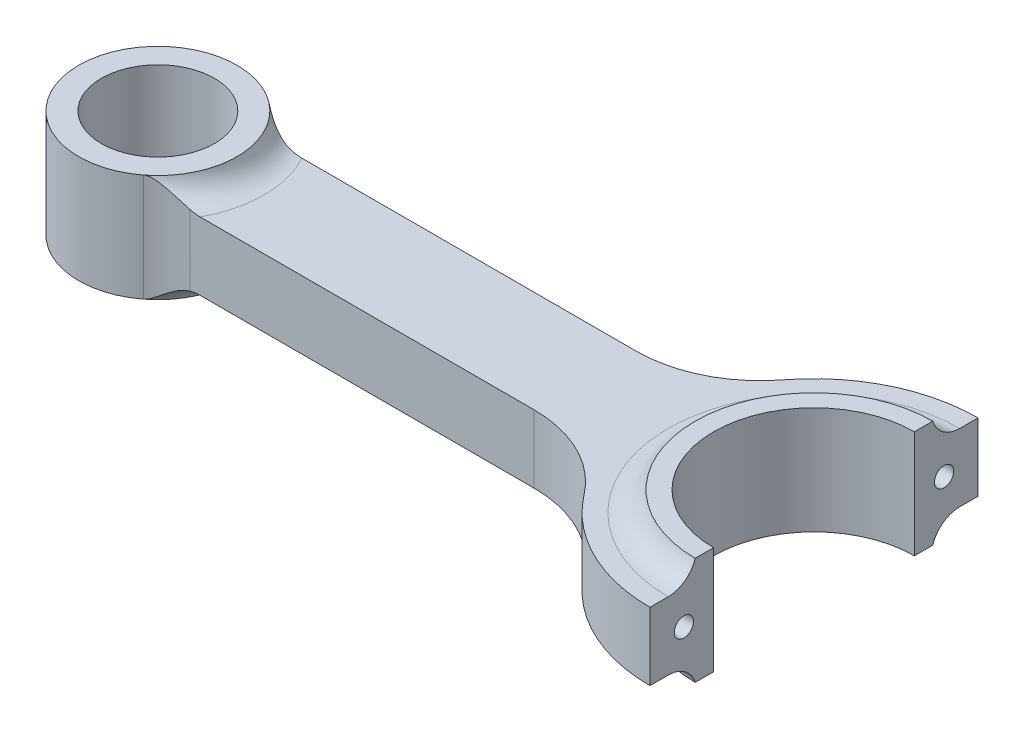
ISO-10303-21;
HEADER;
FILE_DESCRIPTION(('STEP AP214'),'2;1');
FILE_NAME('part.step','',(''),(''),'','','');
FILE_SCHEMA(('AUTOMOTIVE_DESIGN { 1 0 10303 214 1 1 1 1 }'));
ENDSEC;
DATA;
#1=APPLICATION_CONTEXT('core data for automotive mechanical design processes');
#2=APPLICATION_PROTOCOL_DEFINITION('international standard','automotive_design',2000,#1);
#3=PRODUCT_CONTEXT('',#1,'mechanical');
#4=PRODUCT('Part','Part','',(#3));
#5=PRODUCT_RELATED_PRODUCT_CATEGORY('part','',(#4));
#6=PRODUCT_DEFINITION_FORMATION('','',#4);
#7=PRODUCT_DEFINITION_CONTEXT('part definition',#1,'design');
#8=PRODUCT_DEFINITION('design','',#6,#7);
#9=PRODUCT_DEFINITION_SHAPE('','',#8);
#10=(LENGTH_UNIT() NAMED_UNIT(*) SI_UNIT(.MILLI.,.METRE.));
#11=(NAMED_UNIT(*) PLANE_ANGLE_UNIT() SI_UNIT($,.RADIAN.));
#12=(NAMED_UNIT(*) SI_UNIT($,.STERADIAN.) SOLID_ANGLE_UNIT());
#13=UNCERTAINTY_MEASURE_WITH_UNIT(LENGTH_MEASURE(1.E-05),#10,'distance_accuracy_value','');
#14=(GEOMETRIC_REPRESENTATION_CONTEXT(3) GLOBAL_UNCERTAINTY_ASSIGNED_CONTEXT((#13)) GLOBAL_UNIT_ASSIGNED_CONTEXT((#10,
#11,#12)) REPRESENTATION_CONTEXT('',''));
#15=CARTESIAN_POINT('',(0.,0.,0.));
#16=DIRECTION('',(0.,0.,1.));
#17=DIRECTION('',(1.,0.,0.));
#18=AXIS2_PLACEMENT_3D('',#15,#16,#17);
#19=CARTESIAN_POINT('',(0.,-10.0254037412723,-51.7070723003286));
#20=DIRECTION('',(-1.,0.,0.));
#21=DIRECTION('',(0.,0.,1.));
#22=AXIS2_PLACEMENT_3D('',#19,#20,#21);
#23=PLANE('',#22);
#24=CARTESIAN_POINT('',(0.,0.,-23.));
#25=DIRECTION('',(-1.,0.,0.));
#26=DIRECTION('',(0.,0.,1.));
#27=AXIS2_PLACEMENT_3D('',#24,#25,#26);
#28=CIRCLE('',#27,1.7);
#29=CARTESIAN_POINT('',(0.,0.,-21.3));
#30=VERTEX_POINT('',#29);
#31=EDGE_CURVE('E176',#30,#30,#28,.T.);
#32=ORIENTED_EDGE('',*,*,#31,.T.);
#33=EDGE_LOOP('',(#32));
#34=FACE_BOUND('',#33,.T.);
#35=CARTESIAN_POINT('',(0.,-11.,-25.7696960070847));
#36=DIRECTION('',(-1.,0.,0.));
#37=DIRECTION('',(0.,0.,1.));
#38=AXIS2_PLACEMENT_3D('',#35,#36,#37);
#39=CIRCLE('',#38,5.);
#40=CARTESIAN_POINT('',(0.,-6.,-25.7696960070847));
#41=VERTEX_POINT('',#40);
#42=CARTESIAN_POINT('',(0.,-9.5,-21.));
#43=VERTEX_POINT('',#42);
#44=EDGE_CURVE('E337',#41,#43,#39,.F.);
#45=ORIENTED_EDGE('',*,*,#44,.F.);
#46=DIRECTION('',(0.,0.,1.));
#47=VECTOR('',#46,1.);
#48=CARTESIAN_POINT('',(0.,-6.,0.));
#49=LINE('',#48,#47);
#50=CARTESIAN_POINT('',(0.,-6.,-29.));
#51=VERTEX_POINT('',#50);
#52=EDGE_CURVE('E327',#51,#41,#49,.T.);
#53=ORIENTED_EDGE('',*,*,#52,.F.);
#54=DIRECTION('',(0.,-1.,0.));
#55=VECTOR('',#54,1.);
#56=CARTESIAN_POINT('',(0.,6.,-29.));
#57=LINE('',#56,#55);
#58=CARTESIAN_POINT('',(0.,6.,-29.));
#59=VERTEX_POINT('',#58);
#60=EDGE_CURVE('E11',#51,#59,#57,.F.);
#61=ORIENTED_EDGE('',*,*,#60,.T.);
#62=DIRECTION('',(0.,0.,1.));
#63=VECTOR('',#62,1.);
#64=CARTESIAN_POINT('',(0.,6.,0.));
#65=LINE('',#64,#63);
#66=CARTESIAN_POINT('',(0.,6.,-25.7696960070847));
#67=VERTEX_POINT('',#66);
#68=EDGE_CURVE('E54',#59,#67,#65,.T.);
#69=ORIENTED_EDGE('',*,*,#68,.T.);
#70=CARTESIAN_POINT('',(0.,11.,-25.7696960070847));
#71=DIRECTION('',(-1.,0.,0.));
#72=DIRECTION('',(0.,0.,1.));
#73=AXIS2_PLACEMENT_3D('',#70,#71,#72);
#74=CIRCLE('',#73,5.);
#75=CARTESIAN_POINT('',(0.,9.5,-21.));
#76=VERTEX_POINT('',#75);
#77=EDGE_CURVE('E336',#76,#67,#74,.F.);
#78=ORIENTED_EDGE('',*,*,#77,.F.);
#79=DIRECTION('',(0.,0.,1.));
#80=VECTOR('',#79,1.);
#81=CARTESIAN_POINT('',(0.,9.5,0.));
#82=LINE('',#81,#80);
#83=CARTESIAN_POINT('',(0.,9.5,-17.75));
#84=VERTEX_POINT('',#83);
#85=EDGE_CURVE('E342',#76,#84,#82,.T.);
#86=ORIENTED_EDGE('',*,*,#85,.T.);
#87=DIRECTION('',(0.,-1.,0.));
#88=VECTOR('',#87,1.);
#89=CARTESIAN_POINT('',(0.,6.,-17.75));
#90=LINE('',#89,#88);
#91=CARTESIAN_POINT('',(0.,-9.5,-17.75));
#92=VERTEX_POINT('',#91);
#93=EDGE_CURVE('E333',#84,#92,#90,.T.);
#94=ORIENTED_EDGE('',*,*,#93,.T.);
#95=DIRECTION('',(0.,0.,1.));
#96=VECTOR('',#95,1.);
#97=CARTESIAN_POINT('',(0.,-9.5,0.));
#98=LINE('',#97,#96);
#99=EDGE_CURVE('E346',#43,#92,#98,.T.);
#100=ORIENTED_EDGE('',*,*,#99,.F.);
#101=EDGE_LOOP('',(#45,#53,#61,#69,#78,#86,#94,#100));
#102=FACE_BOUND('',#101,.T.);
#103=ADVANCED_FACE('F32',(#34,#102),#23,.F.);
#104=CARTESIAN_POINT('',(0.,0.,23.));
#105=DIRECTION('',(-1.,0.,0.));
#106=DIRECTION('',(0.,0.,1.));
#107=AXIS2_PLACEMENT_3D('',#104,#105,#106);
#108=CIRCLE('',#107,1.7);
#109=CARTESIAN_POINT('',(0.,0.,24.7));
#110=VERTEX_POINT('',#109);
#111=EDGE_CURVE('E35',#110,#110,#108,.T.);
#112=ORIENTED_EDGE('',*,*,#111,.T.);
#113=EDGE_LOOP('',(#112));
#114=FACE_BOUND('',#113,.T.);
#115=DIRECTION('',(0.,-1.,0.));
#116=VECTOR('',#115,1.);
#117=CARTESIAN_POINT('',(0.,6.,17.75));
#118=LINE('',#117,#116);
#119=CARTESIAN_POINT('',(0.,-9.5,17.75));
#120=VERTEX_POINT('',#119);
#121=CARTESIAN_POINT('',(0.,9.5,17.75));
#122=VERTEX_POINT('',#121);
#123=EDGE_CURVE('E343',#120,#122,#118,.F.);
#124=ORIENTED_EDGE('',*,*,#123,.T.);
#125=CARTESIAN_POINT('',(0.,9.5,21.));
#126=VERTEX_POINT('',#125);
#127=EDGE_CURVE('E40',#122,#126,#82,.T.);
#128=ORIENTED_EDGE('',*,*,#127,.T.);
#129=CARTESIAN_POINT('',(0.,11.,25.7696960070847));
#130=DIRECTION('',(-1.,0.,0.));
#131=DIRECTION('',(0.,0.,1.));
#132=AXIS2_PLACEMENT_3D('',#129,#130,#131);
#133=CIRCLE('',#132,5.);
#134=CARTESIAN_POINT('',(0.,6.,25.7696960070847));
#135=VERTEX_POINT('',#134);
#136=EDGE_CURVE('E338',#135,#126,#133,.F.);
#137=ORIENTED_EDGE('',*,*,#136,.F.);
#138=CARTESIAN_POINT('',(0.,6.,29.));
#139=VERTEX_POINT('',#138);
#140=EDGE_CURVE('E330',#135,#139,#65,.T.);
#141=ORIENTED_EDGE('',*,*,#140,.T.);
#142=DIRECTION('',(0.,-1.,0.));
#143=VECTOR('',#142,1.);
#144=CARTESIAN_POINT('',(0.,6.,29.));
#145=LINE('',#144,#143);
#146=CARTESIAN_POINT('',(0.,-6.,29.));
#147=VERTEX_POINT('',#146);
#148=EDGE_CURVE('E177',#147,#139,#145,.F.);
#149=ORIENTED_EDGE('',*,*,#148,.F.);
#150=CARTESIAN_POINT('',(0.,-6.,25.7696960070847));
#151=VERTEX_POINT('',#150);
#152=EDGE_CURVE('E329',#151,#147,#49,.T.);
#153=ORIENTED_EDGE('',*,*,#152,.F.);
#154=CARTESIAN_POINT('',(0.,-11.,25.7696960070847));
#155=DIRECTION('',(-1.,0.,0.));
#156=DIRECTION('',(0.,0.,1.));
#157=AXIS2_PLACEMENT_3D('',#154,#155,#156);
#158=CIRCLE('',#157,5.);
#159=CARTESIAN_POINT('',(0.,-9.5,21.));
#160=VERTEX_POINT('',#159);
#161=EDGE_CURVE('E334',#160,#151,#158,.F.);
#162=ORIENTED_EDGE('',*,*,#161,.F.);
#163=EDGE_CURVE('E321',#120,#160,#98,.T.);
#164=ORIENTED_EDGE('',*,*,#163,.F.);
#165=EDGE_LOOP('',(#124,#128,#137,#141,#149,#153,#162,#164));
#166=FACE_BOUND('',#165,.T.);
#167=ADVANCED_FACE('F373',(#114,#166),#23,.F.);
#168=CARTESIAN_POINT('',(-116.,6.,0.));
#169=DIRECTION('',(0.,-1.,0.));
#170=DIRECTION('',(0.,0.,-1.));
#171=AXIS2_PLACEMENT_3D('',#168,#169,#170);
#172=CYLINDRICAL_SURFACE('',#171,9.99999999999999);
#173=CARTESIAN_POINT('',(-116.,-9.5,0.));
#174=DIRECTION('',(0.,1.,0.));
#175=DIRECTION('',(0.,0.,1.));
#176=AXIS2_PLACEMENT_3D('',#173,#174,#175);
#177=CIRCLE('',#176,9.99999999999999);
#178=CARTESIAN_POINT('',(-116.,-9.5,9.99999999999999));
#179=VERTEX_POINT('',#178);
#180=EDGE_CURVE('E178',#179,#179,#177,.T.);
#181=ORIENTED_EDGE('',*,*,#180,.F.);
#182=EDGE_LOOP('',(#181));
#183=FACE_BOUND('',#182,.T.);
#184=CARTESIAN_POINT('',(-116.,9.5,0.));
#185=DIRECTION('',(0.,1.,0.));
#186=DIRECTION('',(0.,0.,1.));
#187=AXIS2_PLACEMENT_3D('',#184,#185,#186);
#188=CIRCLE('',#187,9.99999999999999);
#189=CARTESIAN_POINT('',(-116.,9.5,9.99999999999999));
#190=VERTEX_POINT('',#189);
#191=EDGE_CURVE('E180',#190,#190,#188,.T.);
#192=ORIENTED_EDGE('',*,*,#191,.T.);
#193=EDGE_LOOP('',(#192));
#194=FACE_BOUND('',#193,.T.);
#195=ADVANCED_FACE('F363',(#183,#194),#172,.F.);
#196=CARTESIAN_POINT('',(-116.,6.,0.));
#197=DIRECTION('',(0.,-1.,0.));
#198=DIRECTION('',(0.,0.,-1.));
#199=AXIS2_PLACEMENT_3D('',#196,#197,#198);
#200=CYLINDRICAL_SURFACE('',#199,14.);
#201=CARTESIAN_POINT('',(-116.,-9.5,0.));
#202=DIRECTION('',(0.,1.,0.));
#203=DIRECTION('',(0.,0.,1.));
#204=AXIS2_PLACEMENT_3D('',#201,#202,#203);
#205=CIRCLE('',#204,14.);
#206=CARTESIAN_POINT('',(-107.446654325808,-9.5,-11.0833333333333));
#207=VERTEX_POINT('',#206);
#208=CARTESIAN_POINT('',(-107.446654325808,-9.5,11.0833333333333));
#209=VERTEX_POINT('',#208);
#210=EDGE_CURVE('E183',#207,#209,#205,.T.);
#211=ORIENTED_EDGE('',*,*,#210,.T.);
#212=DIRECTION('',(0.,-1.,0.));
#213=VECTOR('',#212,1.);
#214=CARTESIAN_POINT('',(-107.446654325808,6.,11.0833333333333));
#215=LINE('',#214,#213);
#216=CARTESIAN_POINT('',(-107.446654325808,9.5,11.0833333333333));
#217=VERTEX_POINT('',#216);
#218=EDGE_CURVE('E244',#209,#217,#215,.F.);
#219=ORIENTED_EDGE('',*,*,#218,.T.);
#220=CARTESIAN_POINT('',(-116.,9.5,0.));
#221=DIRECTION('',(0.,1.,0.));
#222=DIRECTION('',(0.,0.,1.));
#223=AXIS2_PLACEMENT_3D('',#220,#221,#222);
#224=CIRCLE('',#223,14.);
#225=CARTESIAN_POINT('',(-107.446654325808,9.5,-11.0833333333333));
#226=VERTEX_POINT('',#225);
#227=EDGE_CURVE('E190',#226,#217,#224,.T.);
#228=ORIENTED_EDGE('',*,*,#227,.F.);
#229=DIRECTION('',(0.,-1.,0.));
#230=VECTOR('',#229,1.);
#231=CARTESIAN_POINT('',(-107.446654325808,6.,-11.0833333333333));
#232=LINE('',#231,#230);
#233=EDGE_CURVE('E246',#226,#207,#232,.T.);
#234=ORIENTED_EDGE('',*,*,#233,.T.);
#235=EDGE_LOOP('',(#211,#219,#228,#234));
#236=FACE_BOUND('',#235,.T.);
#237=ADVANCED_FACE('F310',(#236),#200,.T.);
#238=CARTESIAN_POINT('',(-116.,9.5,0.));
#239=DIRECTION('',(0.,1.,0.));
#240=DIRECTION('',(0.,0.,1.));
#241=AXIS2_PLACEMENT_3D('',#238,#239,#240);
#242=PLANE('',#241);
#243=EDGE_CURVE('E186',#217,#226,#224,.T.);
#244=ORIENTED_EDGE('',*,*,#243,.T.);
#245=ORIENTED_EDGE('',*,*,#227,.T.);
#246=EDGE_LOOP('',(#244,#245));
#247=FACE_BOUND('',#246,.T.);
#248=ORIENTED_EDGE('',*,*,#191,.F.);
#249=EDGE_LOOP('',(#248));
#250=FACE_BOUND('',#249,.T.);
#251=ADVANCED_FACE('F469',(#247,#250),#242,.T.);
#252=CARTESIAN_POINT('',(-101.337121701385,6.,-19.));
#253=DIRECTION('',(0.,-1.,0.));
#254=DIRECTION('',(0.,0.,-1.));
#255=AXIS2_PLACEMENT_3D('',#252,#253,#254);
#256=CYLINDRICAL_SURFACE('',#255,10.);
#257=ORIENTED_EDGE('',*,*,#233,.F.);
#258=CARTESIAN_POINT('',(-107.446654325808,9.5,-11.0833333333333));
#259=CARTESIAN_POINT('',(-107.394978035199,9.50009163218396,-11.0434429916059));
#260=CARTESIAN_POINT('',(-107.342956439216,9.49651668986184,-11.0041134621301));
#261=CARTESIAN_POINT('',(-107.238911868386,9.48278605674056,-10.9270200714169));
#262=CARTESIAN_POINT('',(-107.186889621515,9.47265494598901,-10.8892509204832));
#263=CARTESIAN_POINT('',(-107.084240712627,9.44683098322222,-10.816203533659));
#264=CARTESIAN_POINT('',(-107.033607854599,9.43126066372,-10.7808894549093));
#265=CARTESIAN_POINT('',(-106.932803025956,9.39548834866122,-10.711931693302));
#266=CARTESIAN_POINT('',(-106.882631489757,9.37528237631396,-10.6782894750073));
#267=CARTESIAN_POINT('',(-106.702822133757,9.29590360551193,-10.5600060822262));
#268=CARTESIAN_POINT('',(-106.574775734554,9.2262057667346,-10.4800991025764));
#269=CARTESIAN_POINT('',(-106.320908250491,9.0742722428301,-10.329143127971));
#270=CARTESIAN_POINT('',(-106.195094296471,8.9920024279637,-10.2581192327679));
#271=CARTESIAN_POINT('',(-105.941096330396,8.81943635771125,-10.1216775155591));
#272=CARTESIAN_POINT('',(-105.812921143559,8.72900323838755,-10.0564176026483));
#273=CARTESIAN_POINT('',(-105.555682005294,8.54556254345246,-9.93224961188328));
#274=CARTESIAN_POINT('',(-105.426619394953,8.45255839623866,-9.87333354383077));
#275=CARTESIAN_POINT('',(-105.089070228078,8.21078885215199,-9.72778428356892));
#276=CARTESIAN_POINT('',(-104.878929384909,8.06170582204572,-9.64546659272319));
#277=CARTESIAN_POINT('',(-104.450332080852,7.76838020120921,-9.49423822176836));
#278=CARTESIAN_POINT('',(-104.231870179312,7.62414089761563,-9.42533649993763));
#279=CARTESIAN_POINT('',(-103.787960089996,7.34685881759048,-9.30228144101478));
#280=CARTESIAN_POINT('',(-103.562637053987,7.21369639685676,-9.24795068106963));
#281=CARTESIAN_POINT('',(-103.101708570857,6.96086512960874,-9.15411360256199));
#282=CARTESIAN_POINT('',(-102.866112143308,6.84118476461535,-9.11459456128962));
#283=CARTESIAN_POINT('',(-102.418742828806,6.63552981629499,-9.05648907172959));
#284=CARTESIAN_POINT('',(-102.208361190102,6.54718243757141,-9.03572176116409));
#285=CARTESIAN_POINT('',(-101.778788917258,6.38621132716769,-9.00741776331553));
#286=CARTESIAN_POINT('',(-101.559538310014,6.31372860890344,-8.99999580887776));
#287=CARTESIAN_POINT('',(-101.337121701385,6.25124935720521,-8.99999999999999));
#288=B_SPLINE_CURVE_WITH_KNOTS('',3,(#258,#259,#260,#261,#262,#263,#264,#265,#266,#267,#268,
#269,#270,#271,#272,#273,#274,#275,#276,#277,#278,#279,#280,#281,#282,#283,#284,#285,#286,#287),
.UNSPECIFIED.,.F.,.F.,(4,2,2,2,2,2,2,2,2,2,2,2,2,2,4),(0.,0.195633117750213,0.390536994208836,
0.581306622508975,0.772240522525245,1.26936960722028,1.76787306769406,2.27735501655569,
2.78618756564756,3.5971674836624,4.40868707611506,5.20982344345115,6.01027007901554,
6.69661570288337,7.38883427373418),.UNSPECIFIED.);
#289=CARTESIAN_POINT('',(-101.337121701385,6.25124935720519,-8.99999999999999));
#290=VERTEX_POINT('',#289);
#291=EDGE_CURVE('E322',#226,#290,#288,.T.);
#292=ORIENTED_EDGE('',*,*,#291,.T.);
#293=DIRECTION('',(0.,-1.,0.));
#294=VECTOR('',#293,1.);
#295=CARTESIAN_POINT('',(-101.337121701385,6.,-8.99999999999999));
#296=LINE('',#295,#294);
#297=CARTESIAN_POINT('',(-101.337121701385,-6.25124935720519,-8.99999999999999));
#298=VERTEX_POINT('',#297);
#299=EDGE_CURVE('E248',#298,#290,#296,.F.);
#300=ORIENTED_EDGE('',*,*,#299,.F.);
#301=CARTESIAN_POINT('',(-101.337121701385,-6.25124935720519,-8.99999999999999));
#302=CARTESIAN_POINT('',(-101.543222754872,-6.30914116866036,-8.99999419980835));
#303=CARTESIAN_POINT('',(-101.746650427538,-6.37564419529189,-9.00636990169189));
#304=CARTESIAN_POINT('',(-102.147027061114,-6.52303846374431,-9.03084019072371));
#305=CARTESIAN_POINT('',(-102.343989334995,-6.60389761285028,-9.04890887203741));
#306=CARTESIAN_POINT('',(-102.729288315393,-6.7765836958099,-9.09549650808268));
#307=CARTESIAN_POINT('',(-102.917691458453,-6.86829319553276,-9.12390943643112));
#308=CARTESIAN_POINT('',(-103.288000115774,-7.06106178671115,-9.19033749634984));
#309=CARTESIAN_POINT('',(-103.469901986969,-7.16212600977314,-9.22835791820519));
#310=CARTESIAN_POINT('',(-103.815663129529,-7.364564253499,-9.3105050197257));
#311=CARTESIAN_POINT('',(-103.979924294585,-7.46548558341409,-9.35406959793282));
#312=CARTESIAN_POINT('',(-104.303336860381,-7.67187424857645,-9.44856287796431));
#313=CARTESIAN_POINT('',(-104.462488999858,-7.77734092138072,-9.49949050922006));
#314=CARTESIAN_POINT('',(-104.776731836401,-7.99128641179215,-9.60868397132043));
#315=CARTESIAN_POINT('',(-104.931812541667,-8.09977149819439,-9.66696612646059));
#316=CARTESIAN_POINT('',(-105.238483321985,-8.31740480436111,-9.79094128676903));
#317=CARTESIAN_POINT('',(-105.390073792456,-8.42655294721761,-9.85663344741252));
#318=CARTESIAN_POINT('',(-105.627284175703,-8.59663679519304,-9.96652872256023));
#319=CARTESIAN_POINT('',(-105.713593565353,-8.65837130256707,-10.0080170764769));
#320=CARTESIAN_POINT('',(-105.885912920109,-8.78017242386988,-10.0939473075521));
#321=CARTESIAN_POINT('',(-105.971922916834,-8.84023921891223,-10.1383888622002));
#322=CARTESIAN_POINT('',(-106.144195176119,-8.95754608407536,-10.2306439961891));
#323=CARTESIAN_POINT('',(-106.230457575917,-9.01478408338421,-10.2784599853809));
#324=CARTESIAN_POINT('',(-106.403738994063,-9.12449596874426,-10.3779725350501));
#325=CARTESIAN_POINT('',(-106.490757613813,-9.17697221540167,-10.4296671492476));
#326=CARTESIAN_POINT('',(-106.683863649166,-9.2841941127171,-10.5485082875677));
#327=CARTESIAN_POINT('',(-106.790274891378,-9.33728368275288,-10.6166743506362));
#328=CARTESIAN_POINT('',(-107.005317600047,-9.42441466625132,-10.7605822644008));
#329=CARTESIAN_POINT('',(-107.113928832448,-9.45858423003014,-10.8362689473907));
#330=CARTESIAN_POINT('',(-107.259959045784,-9.48574850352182,-10.9425714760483));
#331=CARTESIAN_POINT('',(-107.297341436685,-9.49104955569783,-10.9701835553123));
#332=CARTESIAN_POINT('',(-107.372096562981,-9.49819147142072,-11.0262135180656));
#333=CARTESIAN_POINT('',(-107.409468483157,-9.50001650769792,-11.0546344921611));
#334=CARTESIAN_POINT('',(-107.446654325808,-9.50000000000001,-11.0833333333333));
#335=B_SPLINE_CURVE_WITH_KNOTS('',3,(#301,#302,#303,#304,#305,#306,#307,#308,#309,#310,#311,
#312,#313,#314,#315,#316,#317,#318,#319,#320,#321,#322,#323,#324,#325,#326,#327,#328,#329,#330,
#331,#332,#333,#334),.UNSPECIFIED.,.F.,.F.,(4,2,2,2,2,2,2,2,2,2,2,2,2,2,2,2,4),(0.,
0.641594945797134,1.28177327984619,1.91556660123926,2.54970967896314,3.142372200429,
3.73494863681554,4.32886430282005,4.92271234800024,5.26448719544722,5.60622477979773,
5.94820893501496,6.29002261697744,6.70039793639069,7.1079585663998,7.2481629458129,
7.38900420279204),.UNSPECIFIED.);
#336=EDGE_CURVE('E300',#298,#207,#335,.T.);
#337=ORIENTED_EDGE('',*,*,#336,.T.);
#338=EDGE_LOOP('',(#257,#292,#300,#337));
#339=FACE_BOUND('',#338,.T.);
#340=ADVANCED_FACE('F465',(#339),#256,.F.);
#341=CARTESIAN_POINT('',(-116.,-9.5,0.));
#342=DIRECTION('',(0.,1.,0.));
#343=DIRECTION('',(0.,0.,1.));
#344=AXIS2_PLACEMENT_3D('',#341,#342,#343);
#345=PLANE('',#344);
#346=EDGE_CURVE('E191',#209,#207,#205,.T.);
#347=ORIENTED_EDGE('',*,*,#346,.F.);
#348=ORIENTED_EDGE('',*,*,#210,.F.);
#349=EDGE_LOOP('',(#347,#348));
#350=FACE_BOUND('',#349,.T.);
#351=ORIENTED_EDGE('',*,*,#180,.T.);
#352=EDGE_LOOP('',(#351));
#353=FACE_BOUND('',#352,.T.);
#354=ADVANCED_FACE('F468',(#350,#353),#345,.F.);
#355=CARTESIAN_POINT('',(-101.337121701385,6.,19.));
#356=DIRECTION('',(0.,-1.,0.));
#357=DIRECTION('',(0.,0.,-1.));
#358=AXIS2_PLACEMENT_3D('',#355,#356,#357);
#359=CYLINDRICAL_SURFACE('',#358,10.);
#360=DIRECTION('',(0.,1.,0.));
#361=VECTOR('',#360,1.);
#362=CARTESIAN_POINT('',(-101.337121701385,-6.,9.00000000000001));
#363=LINE('',#362,#361);
#364=CARTESIAN_POINT('',(-101.337121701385,6.2512493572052,9.00000000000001));
#365=VERTEX_POINT('',#364);
#366=CARTESIAN_POINT('',(-101.337121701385,-6.2512493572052,9.00000000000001));
#367=VERTEX_POINT('',#366);
#368=EDGE_CURVE('E250',#365,#367,#363,.F.);
#369=ORIENTED_EDGE('',*,*,#368,.F.);
#370=CARTESIAN_POINT('',(-101.337121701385,6.2512493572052,9.00000000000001));
#371=CARTESIAN_POINT('',(-101.543222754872,6.30914116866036,8.99999419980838));
#372=CARTESIAN_POINT('',(-101.746650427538,6.37564419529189,9.0063699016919));
#373=CARTESIAN_POINT('',(-102.147027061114,6.52303846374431,9.03084019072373));
#374=CARTESIAN_POINT('',(-102.343989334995,6.60389761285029,9.04890887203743));
#375=CARTESIAN_POINT('',(-102.729288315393,6.77658369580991,9.09549650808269));
#376=CARTESIAN_POINT('',(-102.917691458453,6.86829319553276,9.12390943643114));
#377=CARTESIAN_POINT('',(-103.288000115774,7.06106178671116,9.19033749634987));
#378=CARTESIAN_POINT('',(-103.469901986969,7.16212600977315,9.22835791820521));
#379=CARTESIAN_POINT('',(-103.815663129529,7.36456425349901,9.31050501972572));
#380=CARTESIAN_POINT('',(-103.979924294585,7.4654855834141,9.35406959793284));
#381=CARTESIAN_POINT('',(-104.303336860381,7.67187424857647,9.44856287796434));
#382=CARTESIAN_POINT('',(-104.462488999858,7.77734092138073,9.49949050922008));
#383=CARTESIAN_POINT('',(-104.776731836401,7.99128641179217,9.60868397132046));
#384=CARTESIAN_POINT('',(-104.931812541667,8.09977149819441,9.66696612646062));
#385=CARTESIAN_POINT('',(-105.238483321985,8.31740480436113,9.79094128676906));
#386=CARTESIAN_POINT('',(-105.390073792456,8.42655294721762,9.85663344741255));
#387=CARTESIAN_POINT('',(-105.627284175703,8.59663679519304,9.96652872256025));
#388=CARTESIAN_POINT('',(-105.713593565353,8.65837130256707,10.0080170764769));
#389=CARTESIAN_POINT('',(-105.885912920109,8.78017242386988,10.0939473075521));
#390=CARTESIAN_POINT('',(-105.971922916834,8.84023921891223,10.1383888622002));
#391=CARTESIAN_POINT('',(-106.144195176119,8.95754608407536,10.2306439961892));
#392=CARTESIAN_POINT('',(-106.230457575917,9.01478408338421,10.2784599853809));
#393=CARTESIAN_POINT('',(-106.403738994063,9.12449596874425,10.3779725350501));
#394=CARTESIAN_POINT('',(-106.490757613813,9.17697221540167,10.4296671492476));
#395=CARTESIAN_POINT('',(-106.683863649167,9.2841941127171,10.5485082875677));
#396=CARTESIAN_POINT('',(-106.790274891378,9.33728368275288,10.6166743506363));
#397=CARTESIAN_POINT('',(-107.005317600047,9.42441466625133,10.7605822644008));
#398=CARTESIAN_POINT('',(-107.113928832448,9.45858423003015,10.8362689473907));
#399=CARTESIAN_POINT('',(-107.259959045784,9.48574850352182,10.9425714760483));
#400=CARTESIAN_POINT('',(-107.297341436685,9.49104955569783,10.9701835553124));
#401=CARTESIAN_POINT('',(-107.372096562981,9.49819147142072,11.0262135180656));
#402=CARTESIAN_POINT('',(-107.409468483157,9.50001650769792,11.0546344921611));
#403=CARTESIAN_POINT('',(-107.446654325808,9.50000000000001,11.0833333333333));
#404=B_SPLINE_CURVE_WITH_KNOTS('',3,(#370,#371,#372,#373,#374,#375,#376,#377,#378,#379,#380,
#381,#382,#383,#384,#385,#386,#387,#388,#389,#390,#391,#392,#393,#394,#395,#396,#397,#398,#399,
#400,#401,#402,#403),.UNSPECIFIED.,.F.,.F.,(4,2,2,2,2,2,2,2,2,2,2,2,2,2,2,2,4),(0.,
0.641594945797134,1.28177327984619,1.91556660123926,2.54970967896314,3.142372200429,
3.73494863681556,4.32886430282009,4.92271234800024,5.26448719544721,5.60622477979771,
5.94820893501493,6.29002261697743,6.70039793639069,7.10795856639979,7.24816294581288,
7.38900420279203),.UNSPECIFIED.);
#405=EDGE_CURVE('E450',#365,#217,#404,.T.);
#406=ORIENTED_EDGE('',*,*,#405,.T.);
#407=ORIENTED_EDGE('',*,*,#218,.F.);
#408=CARTESIAN_POINT('',(-107.446654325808,-9.5,11.0833333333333));
#409=CARTESIAN_POINT('',(-107.394978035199,-9.50009163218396,11.0434429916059));
#410=CARTESIAN_POINT('',(-107.342956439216,-9.49651668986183,11.0041134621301));
#411=CARTESIAN_POINT('',(-107.238911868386,-9.48278605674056,10.9270200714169));
#412=CARTESIAN_POINT('',(-107.186889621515,-9.47265494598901,10.8892509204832));
#413=CARTESIAN_POINT('',(-107.084240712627,-9.44683098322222,10.816203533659));
#414=CARTESIAN_POINT('',(-107.033607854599,-9.43126066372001,10.7808894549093));
#415=CARTESIAN_POINT('',(-106.932803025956,-9.39548834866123,10.711931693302));
#416=CARTESIAN_POINT('',(-106.882631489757,-9.37528237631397,10.6782894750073));
#417=CARTESIAN_POINT('',(-106.702822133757,-9.29590360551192,10.5600060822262));
#418=CARTESIAN_POINT('',(-106.574775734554,-9.22620576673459,10.4800991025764));
#419=CARTESIAN_POINT('',(-106.320908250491,-9.0742722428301,10.329143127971));
#420=CARTESIAN_POINT('',(-106.195094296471,-8.9920024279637,10.2581192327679));
#421=CARTESIAN_POINT('',(-105.941096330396,-8.81943635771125,10.1216775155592));
#422=CARTESIAN_POINT('',(-105.812921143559,-8.72900323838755,10.0564176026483));
#423=CARTESIAN_POINT('',(-105.555682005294,-8.54556254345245,9.93224961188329));
#424=CARTESIAN_POINT('',(-105.426619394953,-8.45255839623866,9.87333354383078));
#425=CARTESIAN_POINT('',(-105.089070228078,-8.21078885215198,9.72778428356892));
#426=CARTESIAN_POINT('',(-104.878929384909,-8.06170582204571,9.6454665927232));
#427=CARTESIAN_POINT('',(-104.450332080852,-7.7683802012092,9.49423822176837));
#428=CARTESIAN_POINT('',(-104.231870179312,-7.62414089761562,9.42533649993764));
#429=CARTESIAN_POINT('',(-103.787960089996,-7.34685881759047,9.3022814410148));
#430=CARTESIAN_POINT('',(-103.562637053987,-7.21369639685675,9.24795068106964));
#431=CARTESIAN_POINT('',(-103.101708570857,-6.96086512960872,9.154113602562));
#432=CARTESIAN_POINT('',(-102.866112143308,-6.84118476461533,9.11459456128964));
#433=CARTESIAN_POINT('',(-102.418742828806,-6.63552981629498,9.05648907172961));
#434=CARTESIAN_POINT('',(-102.208361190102,-6.5471824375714,9.03572176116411));
#435=CARTESIAN_POINT('',(-101.778788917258,-6.38621132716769,9.00741776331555));
#436=CARTESIAN_POINT('',(-101.559538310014,-6.31372860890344,8.99999580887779));
#437=CARTESIAN_POINT('',(-101.337121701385,-6.25124935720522,9.00000000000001));
#438=B_SPLINE_CURVE_WITH_KNOTS('',3,(#408,#409,#410,#411,#412,#413,#414,#415,#416,#417,#418,
#419,#420,#421,#422,#423,#424,#425,#426,#427,#428,#429,#430,#431,#432,#433,#434,#435,#436,#437),
.UNSPECIFIED.,.F.,.F.,(4,2,2,2,2,2,2,2,2,2,2,2,2,2,4),(0.,0.19563311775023,0.390536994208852,
0.581306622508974,0.772240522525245,1.26936960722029,1.76787306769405,2.2773550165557,
2.78618756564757,3.59716748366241,4.40868707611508,5.20982344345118,6.01027007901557,
6.69661570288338,7.38883427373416),.UNSPECIFIED.);
#439=EDGE_CURVE('E262',#209,#367,#438,.T.);
#440=ORIENTED_EDGE('',*,*,#439,.T.);
#441=EDGE_LOOP('',(#369,#406,#407,#440));
#442=FACE_BOUND('',#441,.T.);
#443=ADVANCED_FACE('F276',(#442),#359,.F.);
#444=CARTESIAN_POINT('',(-116.,11.,0.));
#445=DIRECTION('',(0.,1.,0.));
#446=DIRECTION('',(0.,0.,1.));
#447=AXIS2_PLACEMENT_3D('',#444,#445,#446);
#448=TOROIDAL_SURFACE('',#447,18.7696960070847,5.);
#449=ORIENTED_EDGE('',*,*,#291,.F.);
#450=ORIENTED_EDGE('',*,*,#243,.F.);
#451=ORIENTED_EDGE('',*,*,#405,.F.);
#452=CARTESIAN_POINT('',(-99.528767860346,6.,9.00000000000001));
#453=CARTESIAN_POINT('',(-99.6817643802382,5.99999777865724,9.00000000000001));
#454=CARTESIAN_POINT('',(-99.8347469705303,6.0054075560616,9.00000000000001));
#455=CARTESIAN_POINT('',(-100.13926071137,6.02677361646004,9.00000000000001));
#456=CARTESIAN_POINT('',(-100.290795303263,6.04268073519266,9.00000000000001));
#457=CARTESIAN_POINT('',(-100.592399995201,6.08476482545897,9.00000000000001));
#458=CARTESIAN_POINT('',(-100.742470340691,6.11094004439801,9.00000000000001));
#459=CARTESIAN_POINT('',(-101.041206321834,6.17347790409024,9.00000000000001));
#460=CARTESIAN_POINT('',(-101.189862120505,6.20988756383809,9.00000000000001));
#461=CARTESIAN_POINT('',(-101.337121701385,6.25124935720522,9.00000000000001));
#462=B_SPLINE_CURVE_WITH_KNOTS('',3,(#452,#453,#454,#455,#456,#457,#458,#459,#460,#461),
.UNSPECIFIED.,.F.,.F.,(4,2,2,2,4),(0.,0.458873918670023,0.9156138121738,1.37227578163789,
1.83107103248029),.UNSPECIFIED.);
#463=CARTESIAN_POINT('',(-99.528767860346,6.,9.00000000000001));
#464=VERTEX_POINT('',#463);
#465=EDGE_CURVE('E439',#464,#365,#462,.T.);
#466=ORIENTED_EDGE('',*,*,#465,.F.);
#467=CARTESIAN_POINT('',(-116.,6.,0.));
#468=DIRECTION('',(0.,1.,0.));
#469=DIRECTION('',(0.,0.,1.));
#470=AXIS2_PLACEMENT_3D('',#467,#468,#469);
#471=CIRCLE('',#470,18.7696960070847);
#472=CARTESIAN_POINT('',(-99.528767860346,6.,-8.99999999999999));
#473=VERTEX_POINT('',#472);
#474=EDGE_CURVE('E252',#473,#464,#471,.F.);
#475=ORIENTED_EDGE('',*,*,#474,.F.);
#476=CARTESIAN_POINT('',(-101.337121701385,6.25124935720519,-8.99999999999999));
#477=CARTESIAN_POINT('',(-101.189862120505,6.20988756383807,-8.99999999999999));
#478=CARTESIAN_POINT('',(-101.041206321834,6.17347790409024,-8.99999999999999));
#479=CARTESIAN_POINT('',(-100.742470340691,6.11094004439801,-8.99999999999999));
#480=CARTESIAN_POINT('',(-100.592399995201,6.08476482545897,-8.99999999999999));
#481=CARTESIAN_POINT('',(-100.290795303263,6.04268073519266,-8.99999999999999));
#482=CARTESIAN_POINT('',(-100.13926071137,6.02677361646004,-8.99999999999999));
#483=CARTESIAN_POINT('',(-99.8347469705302,6.0054075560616,-8.99999999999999));
#484=CARTESIAN_POINT('',(-99.6817643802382,5.99999777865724,-8.99999999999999));
#485=CARTESIAN_POINT('',(-99.528767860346,6.,-8.99999999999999));
#486=B_SPLINE_CURVE_WITH_KNOTS('',3,(#476,#477,#478,#479,#480,#481,#482,#483,#484,#485),
.UNSPECIFIED.,.F.,.F.,(4,2,2,2,4),(0.,0.458795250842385,0.915457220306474,1.37219711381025,
1.83107103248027),.UNSPECIFIED.);
#487=EDGE_CURVE('E315',#290,#473,#486,.T.);
#488=ORIENTED_EDGE('',*,*,#487,.F.);
#489=EDGE_LOOP('',(#449,#450,#451,#466,#475,#488));
#490=FACE_BOUND('',#489,.T.);
#491=ADVANCED_FACE('F288',(#490),#448,.F.);
#492=CARTESIAN_POINT('',(0.,6.,-8.99999999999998));
#493=DIRECTION('',(0.,0.,-1.));
#494=DIRECTION('',(-1.,0.,0.));
#495=AXIS2_PLACEMENT_3D('',#492,#493,#494);
#496=PLANE('',#495);
#497=DIRECTION('',(1.,0.,0.));
#498=VECTOR('',#497,1.);
#499=CARTESIAN_POINT('',(0.,-6.,-8.99999999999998));
#500=LINE('',#499,#498);
#501=CARTESIAN_POINT('',(-99.528767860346,-6.,-8.99999999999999));
#502=VERTEX_POINT('',#501);
#503=CARTESIAN_POINT('',(-40.4969134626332,-6.,-8.99999999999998));
#504=VERTEX_POINT('',#503);
#505=EDGE_CURVE('E209',#502,#504,#500,.T.);
#506=ORIENTED_EDGE('',*,*,#505,.F.);
#507=CARTESIAN_POINT('',(-99.528767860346,-6.,-8.99999999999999));
#508=CARTESIAN_POINT('',(-99.6817643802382,-5.99999777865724,-8.99999999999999));
#509=CARTESIAN_POINT('',(-99.8347469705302,-6.0054075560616,-8.99999999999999));
#510=CARTESIAN_POINT('',(-100.13926071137,-6.02677361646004,-8.99999999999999));
#511=CARTESIAN_POINT('',(-100.290795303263,-6.04268073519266,-8.99999999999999));
#512=CARTESIAN_POINT('',(-100.592399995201,-6.08476482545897,-8.99999999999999));
#513=CARTESIAN_POINT('',(-100.742470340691,-6.110940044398,-8.99999999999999));
#514=CARTESIAN_POINT('',(-101.041206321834,-6.17347790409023,-8.99999999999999));
#515=CARTESIAN_POINT('',(-101.189862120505,-6.20988756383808,-8.99999999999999));
#516=CARTESIAN_POINT('',(-101.337121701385,-6.25124935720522,-8.99999999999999));
#517=B_SPLINE_CURVE_WITH_KNOTS('',3,(#507,#508,#509,#510,#511,#512,#513,#514,#515,#516),
.UNSPECIFIED.,.F.,.F.,(4,2,2,2,4),(0.,0.458873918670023,0.9156138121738,1.37227578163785,
1.83107103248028),.UNSPECIFIED.);
#518=EDGE_CURVE('E294',#502,#298,#517,.T.);
#519=ORIENTED_EDGE('',*,*,#518,.T.);
#520=ORIENTED_EDGE('',*,*,#299,.T.);
#521=ORIENTED_EDGE('',*,*,#487,.T.);
#522=DIRECTION('',(1.,0.,0.));
#523=VECTOR('',#522,1.);
#524=CARTESIAN_POINT('',(0.,6.,-8.99999999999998));
#525=LINE('',#524,#523);
#526=CARTESIAN_POINT('',(-40.4969134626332,6.,-8.99999999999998));
#527=VERTEX_POINT('',#526);
#528=EDGE_CURVE('E213',#473,#527,#525,.T.);
#529=ORIENTED_EDGE('',*,*,#528,.T.);
#530=DIRECTION('',(0.,-1.,0.));
#531=VECTOR('',#530,1.);
#532=CARTESIAN_POINT('',(-40.4969134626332,6.,-8.99999999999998));
#533=LINE('',#532,#531);
#534=EDGE_CURVE('E215',#527,#504,#533,.T.);
#535=ORIENTED_EDGE('',*,*,#534,.T.);
#536=EDGE_LOOP('',(#506,#519,#520,#521,#529,#535));
#537=FACE_BOUND('',#536,.T.);
#538=ADVANCED_FACE('F285',(#537),#496,.T.);
#539=CARTESIAN_POINT('',(-116.,-11.,0.));
#540=DIRECTION('',(0.,1.,0.));
#541=DIRECTION('',(0.,0.,1.));
#542=AXIS2_PLACEMENT_3D('',#539,#540,#541);
#543=TOROIDAL_SURFACE('',#542,18.7696960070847,5.);
#544=ORIENTED_EDGE('',*,*,#518,.F.);
#545=CARTESIAN_POINT('',(-116.,-6.,0.));
#546=DIRECTION('',(0.,1.,0.));
#547=DIRECTION('',(0.,0.,1.));
#548=AXIS2_PLACEMENT_3D('',#545,#546,#547);
#549=CIRCLE('',#548,18.7696960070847);
#550=CARTESIAN_POINT('',(-99.528767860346,-6.,9.00000000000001));
#551=VERTEX_POINT('',#550);
#552=EDGE_CURVE('E257',#551,#502,#549,.T.);
#553=ORIENTED_EDGE('',*,*,#552,.F.);
#554=CARTESIAN_POINT('',(-101.337121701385,-6.2512493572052,9.00000000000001));
#555=CARTESIAN_POINT('',(-101.189862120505,-6.20988756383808,9.00000000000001));
#556=CARTESIAN_POINT('',(-101.041206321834,-6.17347790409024,9.00000000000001));
#557=CARTESIAN_POINT('',(-100.742470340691,-6.11094004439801,9.00000000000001));
#558=CARTESIAN_POINT('',(-100.592399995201,-6.08476482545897,9.00000000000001));
#559=CARTESIAN_POINT('',(-100.290795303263,-6.04268073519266,9.00000000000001));
#560=CARTESIAN_POINT('',(-100.13926071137,-6.02677361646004,9.00000000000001));
#561=CARTESIAN_POINT('',(-99.8347469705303,-6.0054075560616,9.00000000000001));
#562=CARTESIAN_POINT('',(-99.6817643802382,-5.99999777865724,9.00000000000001));
#563=CARTESIAN_POINT('',(-99.528767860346,-6.,9.00000000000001));
#564=B_SPLINE_CURVE_WITH_KNOTS('',3,(#554,#555,#556,#557,#558,#559,#560,#561,#562,#563),
.UNSPECIFIED.,.F.,.F.,(4,2,2,2,4),(0.,0.458795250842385,0.915457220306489,1.37219711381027,
1.83107103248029),.UNSPECIFIED.);
#565=EDGE_CURVE('E270',#367,#551,#564,.T.);
#566=ORIENTED_EDGE('',*,*,#565,.F.);
#567=ORIENTED_EDGE('',*,*,#439,.F.);
#568=ORIENTED_EDGE('',*,*,#346,.T.);
#569=ORIENTED_EDGE('',*,*,#336,.F.);
#570=EDGE_LOOP('',(#544,#553,#566,#567,#568,#569));
#571=FACE_BOUND('',#570,.T.);
#572=ADVANCED_FACE('F280',(#571),#543,.F.);
#573=CARTESIAN_POINT('',(0.,6.,8.99999999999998));
#574=DIRECTION('',(0.,0.,-1.));
#575=DIRECTION('',(-1.,0.,0.));
#576=AXIS2_PLACEMENT_3D('',#573,#574,#575);
#577=PLANE('',#576);
#578=DIRECTION('',(1.,0.,0.));
#579=VECTOR('',#578,1.);
#580=CARTESIAN_POINT('',(0.,6.,8.99999999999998));
#581=LINE('',#580,#579);
#582=CARTESIAN_POINT('',(-40.4969134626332,6.,8.99999999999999));
#583=VERTEX_POINT('',#582);
#584=EDGE_CURVE('E206',#464,#583,#581,.T.);
#585=ORIENTED_EDGE('',*,*,#584,.F.);
#586=ORIENTED_EDGE('',*,*,#465,.T.);
#587=ORIENTED_EDGE('',*,*,#368,.T.);
#588=ORIENTED_EDGE('',*,*,#565,.T.);
#589=DIRECTION('',(1.,0.,0.));
#590=VECTOR('',#589,1.);
#591=CARTESIAN_POINT('',(0.,-6.,8.99999999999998));
#592=LINE('',#591,#590);
#593=CARTESIAN_POINT('',(-40.4969134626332,-6.,8.99999999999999));
#594=VERTEX_POINT('',#593);
#595=EDGE_CURVE('E203',#551,#594,#592,.T.);
#596=ORIENTED_EDGE('',*,*,#595,.T.);
#597=DIRECTION('',(0.,1.,0.));
#598=VECTOR('',#597,1.);
#599=CARTESIAN_POINT('',(-40.4969134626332,6.,8.99999999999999));
#600=LINE('',#599,#598);
#601=EDGE_CURVE('E230',#594,#583,#600,.T.);
#602=ORIENTED_EDGE('',*,*,#601,.T.);
#603=EDGE_LOOP('',(#585,#586,#587,#588,#596,#602));
#604=FACE_BOUND('',#603,.T.);
#605=ADVANCED_FACE('F284',(#604),#577,.F.);
#606=CARTESIAN_POINT('',(-40.4969134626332,6.,-31.));
#607=DIRECTION('',(0.,-1.,0.));
#608=DIRECTION('',(0.,0.,-1.));
#609=AXIS2_PLACEMENT_3D('',#606,#607,#608);
#610=CYLINDRICAL_SURFACE('',#609,22.);
#611=CARTESIAN_POINT('',(-40.4969134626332,6.,-31.));
#612=DIRECTION('',(0.,1.,0.));
#613=DIRECTION('',(0.,0.,1.));
#614=AXIS2_PLACEMENT_3D('',#611,#612,#613);
#615=CIRCLE('',#614,22.);
#616=CARTESIAN_POINT('',(-23.0276566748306,6.,-17.6274509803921));
#617=VERTEX_POINT('',#616);
#618=EDGE_CURVE('E236',#617,#527,#615,.F.);
#619=ORIENTED_EDGE('',*,*,#618,.F.);
#620=DIRECTION('',(0.,-1.,0.));
#621=VECTOR('',#620,1.);
#622=CARTESIAN_POINT('',(-23.0276566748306,6.,-17.6274509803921));
#623=LINE('',#622,#621);
#624=CARTESIAN_POINT('',(-23.0276566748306,-6.,-17.6274509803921));
#625=VERTEX_POINT('',#624);
#626=EDGE_CURVE('E227',#625,#617,#623,.F.);
#627=ORIENTED_EDGE('',*,*,#626,.F.);
#628=CARTESIAN_POINT('',(-40.4969134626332,-6.,-31.));
#629=DIRECTION('',(0.,1.,0.));
#630=DIRECTION('',(0.,0.,1.));
#631=AXIS2_PLACEMENT_3D('',#628,#629,#630);
#632=CIRCLE('',#631,22.);
#633=EDGE_CURVE('E233',#504,#625,#632,.T.);
#634=ORIENTED_EDGE('',*,*,#633,.F.);
#635=ORIENTED_EDGE('',*,*,#534,.F.);
#636=EDGE_LOOP('',(#619,#627,#634,#635));
#637=FACE_BOUND('',#636,.T.);
#638=ADVANCED_FACE('F429',(#637),#610,.F.);
#639=CARTESIAN_POINT('',(0.,-6.,0.));
#640=DIRECTION('',(0.,1.,0.));
#641=DIRECTION('',(0.,0.,1.));
#642=AXIS2_PLACEMENT_3D('',#639,#640,#641);
#643=PLANE('',#642);
#644=CARTESIAN_POINT('',(0.,-6.,0.));
#645=DIRECTION('',(0.,1.,0.));
#646=DIRECTION('',(0.,0.,1.));
#647=AXIS2_PLACEMENT_3D('',#644,#645,#646);
#648=CIRCLE('',#647,29.);
#649=EDGE_CURVE('E217',#51,#625,#648,.T.);
#650=ORIENTED_EDGE('',*,*,#649,.F.);
#651=ORIENTED_EDGE('',*,*,#52,.T.);
#652=CARTESIAN_POINT('',(0.,-6.,0.));
#653=DIRECTION('',(0.,1.,0.));
#654=DIRECTION('',(0.,0.,1.));
#655=AXIS2_PLACEMENT_3D('',#652,#653,#654);
#656=CIRCLE('',#655,25.7696960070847);
#657=EDGE_CURVE('E259',#41,#151,#656,.T.);
#658=ORIENTED_EDGE('',*,*,#657,.T.);
#659=ORIENTED_EDGE('',*,*,#152,.T.);
#660=CARTESIAN_POINT('',(-23.0276566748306,-6.,17.6274509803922));
#661=VERTEX_POINT('',#660);
#662=EDGE_CURVE('E218',#661,#147,#648,.T.);
#663=ORIENTED_EDGE('',*,*,#662,.F.);
#664=CARTESIAN_POINT('',(-40.4969134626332,-6.,31.));
#665=DIRECTION('',(0.,1.,0.));
#666=DIRECTION('',(0.,0.,1.));
#667=AXIS2_PLACEMENT_3D('',#664,#665,#666);
#668=CIRCLE('',#667,22.);
#669=EDGE_CURVE('E239',#661,#594,#668,.T.);
#670=ORIENTED_EDGE('',*,*,#669,.T.);
#671=ORIENTED_EDGE('',*,*,#595,.F.);
#672=ORIENTED_EDGE('',*,*,#552,.T.);
#673=ORIENTED_EDGE('',*,*,#505,.T.);
#674=ORIENTED_EDGE('',*,*,#633,.T.);
#675=EDGE_LOOP('',(#650,#651,#658,#659,#663,#670,#671,#672,#673,#674));
#676=FACE_BOUND('',#675,.T.);
#677=ADVANCED_FACE('F414',(#676),#643,.F.);
#678=CARTESIAN_POINT('',(-40.4969134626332,6.,31.));
#679=DIRECTION('',(0.,-1.,0.));
#680=DIRECTION('',(0.,0.,-1.));
#681=AXIS2_PLACEMENT_3D('',#678,#679,#680);
#682=CYLINDRICAL_SURFACE('',#681,22.);
#683=CARTESIAN_POINT('',(-40.4969134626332,6.,31.));
#684=DIRECTION('',(0.,1.,0.));
#685=DIRECTION('',(0.,0.,1.));
#686=AXIS2_PLACEMENT_3D('',#683,#684,#685);
#687=CIRCLE('',#686,22.);
#688=CARTESIAN_POINT('',(-23.0276566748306,6.,17.6274509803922));
#689=VERTEX_POINT('',#688);
#690=EDGE_CURVE('E242',#583,#689,#687,.F.);
#691=ORIENTED_EDGE('',*,*,#690,.F.);
#692=ORIENTED_EDGE('',*,*,#601,.F.);
#693=ORIENTED_EDGE('',*,*,#669,.F.);
#694=DIRECTION('',(0.,-1.,0.));
#695=VECTOR('',#694,1.);
#696=CARTESIAN_POINT('',(-23.0276566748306,6.,17.6274509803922));
#697=LINE('',#696,#695);
#698=EDGE_CURVE('E224',#689,#661,#697,.T.);
#699=ORIENTED_EDGE('',*,*,#698,.F.);
#700=EDGE_LOOP('',(#691,#692,#693,#699));
#701=FACE_BOUND('',#700,.T.);
#702=ADVANCED_FACE('F409',(#701),#682,.F.);
#703=CARTESIAN_POINT('',(0.,6.,0.));
#704=DIRECTION('',(0.,1.,0.));
#705=DIRECTION('',(0.,0.,1.));
#706=AXIS2_PLACEMENT_3D('',#703,#704,#705);
#707=PLANE('',#706);
#708=ORIENTED_EDGE('',*,*,#68,.F.);
#709=CARTESIAN_POINT('',(0.,6.,0.));
#710=DIRECTION('',(0.,1.,0.));
#711=DIRECTION('',(0.,0.,1.));
#712=AXIS2_PLACEMENT_3D('',#709,#710,#711);
#713=CIRCLE('',#712,29.);
#714=EDGE_CURVE('E208',#59,#617,#713,.T.);
#715=ORIENTED_EDGE('',*,*,#714,.T.);
#716=ORIENTED_EDGE('',*,*,#618,.T.);
#717=ORIENTED_EDGE('',*,*,#528,.F.);
#718=ORIENTED_EDGE('',*,*,#474,.T.);
#719=ORIENTED_EDGE('',*,*,#584,.T.);
#720=ORIENTED_EDGE('',*,*,#690,.T.);
#721=EDGE_CURVE('E210',#689,#139,#713,.T.);
#722=ORIENTED_EDGE('',*,*,#721,.T.);
#723=ORIENTED_EDGE('',*,*,#140,.F.);
#724=CARTESIAN_POINT('',(0.,6.,0.));
#725=DIRECTION('',(0.,1.,0.));
#726=DIRECTION('',(0.,0.,1.));
#727=AXIS2_PLACEMENT_3D('',#724,#725,#726);
#728=CIRCLE('',#727,25.7696960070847);
#729=EDGE_CURVE('E255',#135,#67,#728,.F.);
#730=ORIENTED_EDGE('',*,*,#729,.T.);
#731=EDGE_LOOP('',(#708,#715,#716,#717,#718,#719,#720,#722,#723,#730));
#732=FACE_BOUND('',#731,.T.);
#733=ADVANCED_FACE('F402',(#732),#707,.T.);
#734=CARTESIAN_POINT('',(0.,6.,0.));
#735=DIRECTION('',(0.,-1.,0.));
#736=DIRECTION('',(0.,0.,-1.));
#737=AXIS2_PLACEMENT_3D('',#734,#735,#736);
#738=CYLINDRICAL_SURFACE('',#737,29.);
#739=ORIENTED_EDGE('',*,*,#148,.T.);
#740=ORIENTED_EDGE('',*,*,#721,.F.);
#741=ORIENTED_EDGE('',*,*,#698,.T.);
#742=ORIENTED_EDGE('',*,*,#662,.T.);
#743=EDGE_LOOP('',(#739,#740,#741,#742));
#744=FACE_BOUND('',#743,.T.);
#745=ADVANCED_FACE('F406',(#744),#738,.T.);
#746=ORIENTED_EDGE('',*,*,#714,.F.);
#747=ORIENTED_EDGE('',*,*,#60,.F.);
#748=ORIENTED_EDGE('',*,*,#649,.T.);
#749=ORIENTED_EDGE('',*,*,#626,.T.);
#750=EDGE_LOOP('',(#746,#747,#748,#749));
#751=FACE_BOUND('',#750,.T.);
#752=ADVANCED_FACE('F312',(#751),#738,.T.);
#753=CARTESIAN_POINT('',(0.,-11.,0.));
#754=DIRECTION('',(0.,1.,0.));
#755=DIRECTION('',(0.,0.,1.));
#756=AXIS2_PLACEMENT_3D('',#753,#754,#755);
#757=TOROIDAL_SURFACE('',#756,25.7696960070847,5.);
#758=CARTESIAN_POINT('',(0.,-9.5,0.));
#759=DIRECTION('',(0.,1.,0.));
#760=DIRECTION('',(0.,0.,1.));
#761=AXIS2_PLACEMENT_3D('',#758,#759,#760);
#762=CIRCLE('',#761,21.);
#763=EDGE_CURVE('E197',#43,#160,#762,.T.);
#764=ORIENTED_EDGE('',*,*,#763,.T.);
#765=ORIENTED_EDGE('',*,*,#161,.T.);
#766=ORIENTED_EDGE('',*,*,#657,.F.);
#767=ORIENTED_EDGE('',*,*,#44,.T.);
#768=EDGE_LOOP('',(#764,#765,#766,#767));
#769=FACE_BOUND('',#768,.T.);
#770=ADVANCED_FACE('F287',(#769),#757,.F.);
#771=CARTESIAN_POINT('',(0.,-9.5,0.));
#772=DIRECTION('',(0.,1.,0.));
#773=DIRECTION('',(0.,0.,1.));
#774=AXIS2_PLACEMENT_3D('',#771,#772,#773);
#775=PLANE('',#774);
#776=ORIENTED_EDGE('',*,*,#763,.F.);
#777=ORIENTED_EDGE('',*,*,#99,.T.);
#778=CARTESIAN_POINT('',(0.,-9.5,0.));
#779=DIRECTION('',(0.,1.,0.));
#780=DIRECTION('',(0.,0.,1.));
#781=AXIS2_PLACEMENT_3D('',#778,#779,#780);
#782=CIRCLE('',#781,17.75);
#783=EDGE_CURVE('E189',#92,#120,#782,.T.);
#784=ORIENTED_EDGE('',*,*,#783,.T.);
#785=ORIENTED_EDGE('',*,*,#163,.T.);
#786=EDGE_LOOP('',(#776,#777,#784,#785));
#787=FACE_BOUND('',#786,.T.);
#788=ADVANCED_FACE('F421',(#787),#775,.F.);
#789=CARTESIAN_POINT('',(0.,6.,0.));
#790=DIRECTION('',(0.,-1.,0.));
#791=DIRECTION('',(0.,0.,-1.));
#792=AXIS2_PLACEMENT_3D('',#789,#790,#791);
#793=CYLINDRICAL_SURFACE('',#792,17.75);
#794=ORIENTED_EDGE('',*,*,#93,.F.);
#795=CARTESIAN_POINT('',(0.,9.5,0.));
#796=DIRECTION('',(0.,1.,0.));
#797=DIRECTION('',(0.,0.,1.));
#798=AXIS2_PLACEMENT_3D('',#795,#796,#797);
#799=CIRCLE('',#798,17.75);
#800=EDGE_CURVE('E194',#84,#122,#799,.T.);
#801=ORIENTED_EDGE('',*,*,#800,.T.);
#802=ORIENTED_EDGE('',*,*,#123,.F.);
#803=ORIENTED_EDGE('',*,*,#783,.F.);
#804=EDGE_LOOP('',(#794,#801,#802,#803));
#805=FACE_BOUND('',#804,.T.);
#806=ADVANCED_FACE('F393',(#805),#793,.F.);
#807=CARTESIAN_POINT('',(0.,11.,0.));
#808=DIRECTION('',(0.,1.,0.));
#809=DIRECTION('',(0.,0.,1.));
#810=AXIS2_PLACEMENT_3D('',#807,#808,#809);
#811=TOROIDAL_SURFACE('',#810,25.7696960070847,5.);
#812=ORIENTED_EDGE('',*,*,#729,.F.);
#813=ORIENTED_EDGE('',*,*,#136,.T.);
#814=CARTESIAN_POINT('',(0.,9.5,0.));
#815=DIRECTION('',(0.,1.,0.));
#816=DIRECTION('',(0.,0.,1.));
#817=AXIS2_PLACEMENT_3D('',#814,#815,#816);
#818=CIRCLE('',#817,21.);
#819=EDGE_CURVE('E200',#76,#126,#818,.T.);
#820=ORIENTED_EDGE('',*,*,#819,.F.);
#821=ORIENTED_EDGE('',*,*,#77,.T.);
#822=EDGE_LOOP('',(#812,#813,#820,#821));
#823=FACE_BOUND('',#822,.T.);
#824=ADVANCED_FACE('F370',(#823),#811,.F.);
#825=CARTESIAN_POINT('',(0.,9.5,0.));
#826=DIRECTION('',(0.,1.,0.));
#827=DIRECTION('',(0.,0.,1.));
#828=AXIS2_PLACEMENT_3D('',#825,#826,#827);
#829=PLANE('',#828);
#830=ORIENTED_EDGE('',*,*,#85,.F.);
#831=ORIENTED_EDGE('',*,*,#819,.T.);
#832=ORIENTED_EDGE('',*,*,#127,.F.);
#833=ORIENTED_EDGE('',*,*,#800,.F.);
#834=EDGE_LOOP('',(#830,#831,#832,#833));
#835=FACE_BOUND('',#834,.T.);
#836=ADVANCED_FACE('F360',(#835),#829,.T.);
#837=CARTESIAN_POINT('',(20.,0.,-23.));
#838=DIRECTION('',(1.,0.,0.));
#839=DIRECTION('',(0.,0.,-1.));
#840=AXIS2_PLACEMENT_3D('',#837,#838,#839);
#841=CYLINDRICAL_SURFACE('',#840,1.7);
#842=CARTESIAN_POINT('',(-10.,0.,-23.));
#843=DIRECTION('',(1.,0.,0.));
#844=DIRECTION('',(0.,0.,-1.));
#845=AXIS2_PLACEMENT_3D('',#842,#843,#844);
#846=CIRCLE('',#845,1.69999999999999);
#847=CARTESIAN_POINT('',(-10.,0.,-24.7));
#848=VERTEX_POINT('',#847);
#849=EDGE_CURVE('E172',#848,#848,#846,.T.);
#850=ORIENTED_EDGE('',*,*,#849,.F.);
#851=EDGE_LOOP('',(#850));
#852=FACE_BOUND('',#851,.T.);
#853=ORIENTED_EDGE('',*,*,#31,.F.);
#854=EDGE_LOOP('',(#853));
#855=FACE_BOUND('',#854,.T.);
#856=ADVANCED_FACE('F357',(#852,#855),#841,.F.);
#857=CARTESIAN_POINT('',(-10.,0.,-23.));
#858=DIRECTION('',(1.,0.,0.));
#859=DIRECTION('',(0.,0.,-1.));
#860=AXIS2_PLACEMENT_3D('',#857,#858,#859);
#861=CONICAL_SURFACE('',#860,1.69999999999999,1.02974425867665);
#862=CARTESIAN_POINT('',(-11.0214630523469,0.,-23.));
#863=VERTEX_POINT('',#862);
#864=VERTEX_LOOP('',#863);
#865=FACE_BOUND('',#864,.T.);
#866=ORIENTED_EDGE('',*,*,#849,.T.);
#867=EDGE_LOOP('',(#866));
#868=FACE_BOUND('',#867,.T.);
#869=ADVANCED_FACE('F359',(#865,#868),#861,.F.);
#870=CARTESIAN_POINT('',(20.,0.,23.));
#871=DIRECTION('',(1.,0.,0.));
#872=DIRECTION('',(0.,0.,-1.));
#873=AXIS2_PLACEMENT_3D('',#870,#871,#872);
#874=CYLINDRICAL_SURFACE('',#873,1.7);
#875=CARTESIAN_POINT('',(-9.99999999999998,0.,23.));
#876=DIRECTION('',(1.,0.,0.));
#877=DIRECTION('',(0.,0.,-1.));
#878=AXIS2_PLACEMENT_3D('',#875,#876,#877);
#879=CIRCLE('',#878,1.69999999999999);
#880=CARTESIAN_POINT('',(-9.99999999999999,0.,21.3));
#881=VERTEX_POINT('',#880);
#882=EDGE_CURVE('E168',#881,#881,#879,.T.);
#883=ORIENTED_EDGE('',*,*,#882,.F.);
#884=EDGE_LOOP('',(#883));
#885=FACE_BOUND('',#884,.T.);
#886=ORIENTED_EDGE('',*,*,#111,.F.);
#887=EDGE_LOOP('',(#886));
#888=FACE_BOUND('',#887,.T.);
#889=ADVANCED_FACE('F164',(#885,#888),#874,.F.);
#890=CARTESIAN_POINT('',(-9.99999999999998,0.,23.));
#891=DIRECTION('',(1.,0.,0.));
#892=DIRECTION('',(0.,0.,-1.));
#893=AXIS2_PLACEMENT_3D('',#890,#891,#892);
#894=CONICAL_SURFACE('',#893,1.69999999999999,1.02974425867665);
#895=CARTESIAN_POINT('',(-11.0214630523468,0.,23.));
#896=VERTEX_POINT('',#895);
#897=VERTEX_LOOP('',#896);
#898=FACE_BOUND('',#897,.T.);
#899=ORIENTED_EDGE('',*,*,#882,.T.);
#900=EDGE_LOOP('',(#899));
#901=FACE_BOUND('',#900,.T.);
#902=ADVANCED_FACE('F161',(#898,#901),#894,.F.);
#903=CLOSED_SHELL('',(#103,#167,#195,#237,#251,#340,#354,#443,#491,#538,#572,#605,#638,#677,
#702,#733,#745,#752,#770,#788,#806,#824,#836,#856,#869,#889,#902));
#904=MANIFOLD_SOLID_BREP('B2',#903);
#905=ADVANCED_BREP_SHAPE_REPRESENTATION('',(#18,#904),#14);
#906=SHAPE_DEFINITION_REPRESENTATION(#9,#905);
ENDSEC;
END-ISO-10303-21;
